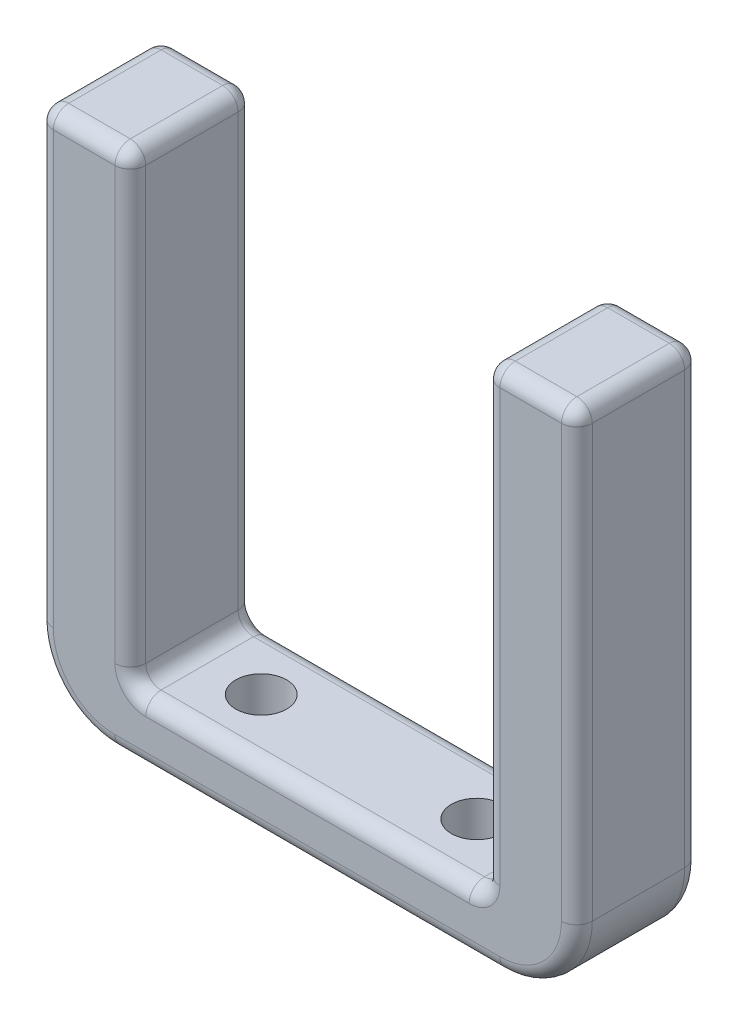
ISO-10303-21;
HEADER;
FILE_DESCRIPTION(('STEP AP214'),'2;1');
FILE_NAME('part.step','',(''),(''),'','','');
FILE_SCHEMA(('AUTOMOTIVE_DESIGN { 1 0 10303 214 1 1 1 1 }'));
ENDSEC;
DATA;
#1=APPLICATION_CONTEXT('core data for automotive mechanical design processes');
#2=APPLICATION_PROTOCOL_DEFINITION('international standard','automotive_design',2000,#1);
#3=PRODUCT_CONTEXT('',#1,'mechanical');
#4=PRODUCT('Part','Part','',(#3));
#5=PRODUCT_RELATED_PRODUCT_CATEGORY('part','',(#4));
#6=PRODUCT_DEFINITION_FORMATION('','',#4);
#7=PRODUCT_DEFINITION_CONTEXT('part definition',#1,'design');
#8=PRODUCT_DEFINITION('design','',#6,#7);
#9=PRODUCT_DEFINITION_SHAPE('','',#8);
#10=(LENGTH_UNIT() NAMED_UNIT(*) SI_UNIT(.MILLI.,.METRE.));
#11=(NAMED_UNIT(*) PLANE_ANGLE_UNIT() SI_UNIT($,.RADIAN.));
#12=(NAMED_UNIT(*) SI_UNIT($,.STERADIAN.) SOLID_ANGLE_UNIT());
#13=UNCERTAINTY_MEASURE_WITH_UNIT(LENGTH_MEASURE(1.E-05),#10,'distance_accuracy_value','');
#14=(GEOMETRIC_REPRESENTATION_CONTEXT(3) GLOBAL_UNCERTAINTY_ASSIGNED_CONTEXT((#13)) GLOBAL_UNIT_ASSIGNED_CONTEXT((#10,
#11,#12)) REPRESENTATION_CONTEXT('',''));
#15=CARTESIAN_POINT('',(0.,0.,0.));
#16=DIRECTION('',(0.,0.,1.));
#17=DIRECTION('',(1.,0.,0.));
#18=AXIS2_PLACEMENT_3D('',#15,#16,#17);
#19=CARTESIAN_POINT('',(0.,0.,8.));
#20=DIRECTION('',(0.,1.,0.));
#21=DIRECTION('',(0.,0.,1.));
#22=AXIS2_PLACEMENT_3D('',#19,#20,#21);
#23=PLANE('',#22);
#24=DIRECTION('',(1.,0.,0.));
#25=VECTOR('',#24,1.);
#26=CARTESIAN_POINT('',(0.,0.,1.));
#27=LINE('',#26,#25);
#28=CARTESIAN_POINT('',(5.,0.,1.));
#29=VERTEX_POINT('',#28);
#30=CARTESIAN_POINT('',(1.,0.,1.));
#31=VERTEX_POINT('',#30);
#32=EDGE_CURVE('E355',#29,#31,#27,.F.);
#33=ORIENTED_EDGE('',*,*,#32,.T.);
#34=DIRECTION('',(0.,0.,-1.));
#35=VECTOR('',#34,1.);
#36=CARTESIAN_POINT('',(1.,0.,8.));
#37=LINE('',#36,#35);
#38=CARTESIAN_POINT('',(1.,0.,7.));
#39=VERTEX_POINT('',#38);
#40=EDGE_CURVE('E359',#31,#39,#37,.F.);
#41=ORIENTED_EDGE('',*,*,#40,.T.);
#42=DIRECTION('',(1.,0.,0.));
#43=VECTOR('',#42,1.);
#44=CARTESIAN_POINT('',(0.,0.,7.));
#45=LINE('',#44,#43);
#46=CARTESIAN_POINT('',(5.,0.,7.));
#47=VERTEX_POINT('',#46);
#48=EDGE_CURVE('E357',#39,#47,#45,.T.);
#49=ORIENTED_EDGE('',*,*,#48,.T.);
#50=DIRECTION('',(0.,0.,1.));
#51=VECTOR('',#50,1.);
#52=CARTESIAN_POINT('',(5.,0.,0.));
#53=LINE('',#52,#51);
#54=EDGE_CURVE('E353',#47,#29,#53,.F.);
#55=ORIENTED_EDGE('',*,*,#54,.T.);
#56=EDGE_LOOP('',(#33,#41,#49,#55));
#57=FACE_BOUND('',#56,.T.);
#58=ADVANCED_FACE('F45',(#57),#23,.T.);
#59=CARTESIAN_POINT('',(0.,0.,8.));
#60=DIRECTION('',(1.,0.,0.));
#61=DIRECTION('',(0.,0.,-1.));
#62=AXIS2_PLACEMENT_3D('',#59,#60,#61);
#63=PLANE('',#62);
#64=DIRECTION('',(0.,0.,-1.));
#65=VECTOR('',#64,1.);
#66=CARTESIAN_POINT('',(0.,-29.,8.));
#67=LINE('',#66,#65);
#68=CARTESIAN_POINT('',(0.,-29.,7.));
#69=VERTEX_POINT('',#68);
#70=CARTESIAN_POINT('',(0.,-29.,1.));
#71=VERTEX_POINT('',#70);
#72=EDGE_CURVE('E256',#69,#71,#67,.T.);
#73=ORIENTED_EDGE('',*,*,#72,.F.);
#74=DIRECTION('',(0.,-1.,0.));
#75=VECTOR('',#74,1.);
#76=CARTESIAN_POINT('',(0.,0.,7.));
#77=LINE('',#76,#75);
#78=CARTESIAN_POINT('',(0.,-1.,7.));
#79=VERTEX_POINT('',#78);
#80=EDGE_CURVE('E351',#69,#79,#77,.F.);
#81=ORIENTED_EDGE('',*,*,#80,.T.);
#82=DIRECTION('',(0.,0.,-1.));
#83=VECTOR('',#82,1.);
#84=CARTESIAN_POINT('',(0.,-1.,0.));
#85=LINE('',#84,#83);
#86=CARTESIAN_POINT('',(0.,-1.,1.));
#87=VERTEX_POINT('',#86);
#88=EDGE_CURVE('E349',#79,#87,#85,.T.);
#89=ORIENTED_EDGE('',*,*,#88,.T.);
#90=DIRECTION('',(0.,-1.,0.));
#91=VECTOR('',#90,1.);
#92=CARTESIAN_POINT('',(0.,0.,1.));
#93=LINE('',#92,#91);
#94=EDGE_CURVE('E347',#87,#71,#93,.T.);
#95=ORIENTED_EDGE('',*,*,#94,.T.);
#96=EDGE_LOOP('',(#73,#81,#89,#95));
#97=FACE_BOUND('',#96,.T.);
#98=ADVANCED_FACE('F550',(#97),#63,.F.);
#99=CARTESIAN_POINT('',(5.,-29.,8.));
#100=DIRECTION('',(0.,0.,-1.));
#101=DIRECTION('',(-1.,0.,0.));
#102=AXIS2_PLACEMENT_3D('',#99,#100,#101);
#103=CYLINDRICAL_SURFACE('',#102,5.);
#104=DIRECTION('',(0.,0.,-1.));
#105=VECTOR('',#104,1.);
#106=CARTESIAN_POINT('',(5.,-34.,8.));
#107=LINE('',#106,#105);
#108=CARTESIAN_POINT('',(5.,-34.,7.));
#109=VERTEX_POINT('',#108);
#110=CARTESIAN_POINT('',(5.,-34.,1.));
#111=VERTEX_POINT('',#110);
#112=EDGE_CURVE('E258',#109,#111,#107,.T.);
#113=ORIENTED_EDGE('',*,*,#112,.F.);
#114=CARTESIAN_POINT('',(5.,-29.,7.));
#115=DIRECTION('',(0.,0.,1.));
#116=DIRECTION('',(1.,0.,0.));
#117=AXIS2_PLACEMENT_3D('',#114,#115,#116);
#118=CIRCLE('',#117,5.);
#119=EDGE_CURVE('E11',#109,#69,#118,.F.);
#120=ORIENTED_EDGE('',*,*,#119,.T.);
#121=ORIENTED_EDGE('',*,*,#72,.T.);
#122=CARTESIAN_POINT('',(5.,-29.,1.));
#123=DIRECTION('',(0.,0.,1.));
#124=DIRECTION('',(1.,0.,0.));
#125=AXIS2_PLACEMENT_3D('',#122,#123,#124);
#126=CIRCLE('',#125,5.);
#127=EDGE_CURVE('E54',#71,#111,#126,.T.);
#128=ORIENTED_EDGE('',*,*,#127,.T.);
#129=EDGE_LOOP('',(#113,#120,#121,#128));
#130=FACE_BOUND('',#129,.T.);
#131=ADVANCED_FACE('F548',(#130),#103,.T.);
#132=CARTESIAN_POINT('',(0.,-34.,8.));
#133=DIRECTION('',(0.,1.,0.));
#134=DIRECTION('',(0.,0.,1.));
#135=AXIS2_PLACEMENT_3D('',#132,#133,#134);
#136=PLANE('',#135);
#137=CARTESIAN_POINT('',(24.5,-34.,4.));
#138=DIRECTION('',(0.,-1.,0.));
#139=DIRECTION('',(0.,0.,-1.));
#140=AXIS2_PLACEMENT_3D('',#137,#138,#139);
#141=CIRCLE('',#140,1.65);
#142=CARTESIAN_POINT('',(24.5,-34.,2.35));
#143=VERTEX_POINT('',#142);
#144=EDGE_CURVE('E481',#143,#143,#141,.T.);
#145=ORIENTED_EDGE('',*,*,#144,.F.);
#146=EDGE_LOOP('',(#145));
#147=FACE_BOUND('',#146,.T.);
#148=CARTESIAN_POINT('',(10.5,-34.,4.));
#149=DIRECTION('',(0.,-1.,0.));
#150=DIRECTION('',(0.,0.,1.));
#151=AXIS2_PLACEMENT_3D('',#148,#149,#150);
#152=CIRCLE('',#151,1.65);
#153=CARTESIAN_POINT('',(10.5,-34.,5.65));
#154=VERTEX_POINT('',#153);
#155=EDGE_CURVE('E486',#154,#154,#152,.T.);
#156=ORIENTED_EDGE('',*,*,#155,.F.);
#157=EDGE_LOOP('',(#156));
#158=FACE_BOUND('',#157,.T.);
#159=DIRECTION('',(0.,0.,-1.));
#160=VECTOR('',#159,1.);
#161=CARTESIAN_POINT('',(30.,-34.,8.));
#162=LINE('',#161,#160);
#163=CARTESIAN_POINT('',(30.,-34.,7.));
#164=VERTEX_POINT('',#163);
#165=CARTESIAN_POINT('',(30.,-34.,1.));
#166=VERTEX_POINT('',#165);
#167=EDGE_CURVE('E507',#164,#166,#162,.T.);
#168=ORIENTED_EDGE('',*,*,#167,.F.);
#169=DIRECTION('',(1.,0.,0.));
#170=VECTOR('',#169,1.);
#171=CARTESIAN_POINT('',(5.,-34.,7.));
#172=LINE('',#171,#170);
#173=EDGE_CURVE('E68',#164,#109,#172,.F.);
#174=ORIENTED_EDGE('',*,*,#173,.T.);
#175=ORIENTED_EDGE('',*,*,#112,.T.);
#176=DIRECTION('',(1.,0.,0.));
#177=VECTOR('',#176,1.);
#178=CARTESIAN_POINT('',(0.,-34.,1.));
#179=LINE('',#178,#177);
#180=EDGE_CURVE('E366',#111,#166,#179,.T.);
#181=ORIENTED_EDGE('',*,*,#180,.T.);
#182=EDGE_LOOP('',(#168,#174,#175,#181));
#183=FACE_BOUND('',#182,.T.);
#184=ADVANCED_FACE('F510',(#147,#158,#183),#136,.F.);
#185=CARTESIAN_POINT('',(30.,-29.,8.));
#186=DIRECTION('',(0.,0.,-1.));
#187=DIRECTION('',(-1.,0.,0.));
#188=AXIS2_PLACEMENT_3D('',#185,#186,#187);
#189=CYLINDRICAL_SURFACE('',#188,5.);
#190=DIRECTION('',(0.,0.,-1.));
#191=VECTOR('',#190,1.);
#192=CARTESIAN_POINT('',(35.,-29.,8.));
#193=LINE('',#192,#191);
#194=CARTESIAN_POINT('',(35.,-29.,7.));
#195=VERTEX_POINT('',#194);
#196=CARTESIAN_POINT('',(35.,-29.,1.));
#197=VERTEX_POINT('',#196);
#198=EDGE_CURVE('E496',#195,#197,#193,.T.);
#199=ORIENTED_EDGE('',*,*,#198,.F.);
#200=CARTESIAN_POINT('',(30.,-29.,7.));
#201=DIRECTION('',(0.,0.,1.));
#202=DIRECTION('',(1.,0.,0.));
#203=AXIS2_PLACEMENT_3D('',#200,#201,#202);
#204=CIRCLE('',#203,5.);
#205=EDGE_CURVE('E364',#195,#164,#204,.F.);
#206=ORIENTED_EDGE('',*,*,#205,.T.);
#207=ORIENTED_EDGE('',*,*,#167,.T.);
#208=CARTESIAN_POINT('',(30.,-29.,1.));
#209=DIRECTION('',(0.,0.,1.));
#210=DIRECTION('',(1.,0.,0.));
#211=AXIS2_PLACEMENT_3D('',#208,#209,#210);
#212=CIRCLE('',#211,5.);
#213=EDGE_CURVE('E362',#166,#197,#212,.T.);
#214=ORIENTED_EDGE('',*,*,#213,.T.);
#215=EDGE_LOOP('',(#199,#206,#207,#214));
#216=FACE_BOUND('',#215,.T.);
#217=ADVANCED_FACE('F523',(#216),#189,.T.);
#218=CARTESIAN_POINT('',(35.,0.,8.));
#219=DIRECTION('',(1.,0.,0.));
#220=DIRECTION('',(0.,0.,-1.));
#221=AXIS2_PLACEMENT_3D('',#218,#219,#220);
#222=PLANE('',#221);
#223=DIRECTION('',(0.,0.,-1.));
#224=VECTOR('',#223,1.);
#225=CARTESIAN_POINT('',(35.,-1.,8.));
#226=LINE('',#225,#224);
#227=CARTESIAN_POINT('',(35.,-1.,1.));
#228=VERTEX_POINT('',#227);
#229=CARTESIAN_POINT('',(35.,-1.,7.));
#230=VERTEX_POINT('',#229);
#231=EDGE_CURVE('E342',#228,#230,#226,.F.);
#232=ORIENTED_EDGE('',*,*,#231,.T.);
#233=DIRECTION('',(0.,-1.,0.));
#234=VECTOR('',#233,1.);
#235=CARTESIAN_POINT('',(35.,0.,7.));
#236=LINE('',#235,#234);
#237=EDGE_CURVE('E345',#230,#195,#236,.T.);
#238=ORIENTED_EDGE('',*,*,#237,.T.);
#239=ORIENTED_EDGE('',*,*,#198,.T.);
#240=DIRECTION('',(0.,-1.,0.));
#241=VECTOR('',#240,1.);
#242=CARTESIAN_POINT('',(35.,0.,1.));
#243=LINE('',#242,#241);
#244=EDGE_CURVE('E340',#197,#228,#243,.F.);
#245=ORIENTED_EDGE('',*,*,#244,.T.);
#246=EDGE_LOOP('',(#232,#238,#239,#245));
#247=FACE_BOUND('',#246,.T.);
#248=ADVANCED_FACE('F526',(#247),#222,.T.);
#249=DIRECTION('',(1.,0.,0.));
#250=VECTOR('',#249,1.);
#251=CARTESIAN_POINT('',(0.,0.,7.));
#252=LINE('',#251,#250);
#253=CARTESIAN_POINT('',(30.,0.,7.));
#254=VERTEX_POINT('',#253);
#255=CARTESIAN_POINT('',(34.,0.,7.));
#256=VERTEX_POINT('',#255);
#257=EDGE_CURVE('E335',#254,#256,#252,.T.);
#258=ORIENTED_EDGE('',*,*,#257,.T.);
#259=DIRECTION('',(0.,0.,-1.));
#260=VECTOR('',#259,1.);
#261=CARTESIAN_POINT('',(34.,0.,8.));
#262=LINE('',#261,#260);
#263=CARTESIAN_POINT('',(34.,0.,1.));
#264=VERTEX_POINT('',#263);
#265=EDGE_CURVE('E337',#256,#264,#262,.T.);
#266=ORIENTED_EDGE('',*,*,#265,.T.);
#267=DIRECTION('',(1.,0.,0.));
#268=VECTOR('',#267,1.);
#269=CARTESIAN_POINT('',(29.,0.,1.));
#270=LINE('',#269,#268);
#271=CARTESIAN_POINT('',(30.,0.,1.));
#272=VERTEX_POINT('',#271);
#273=EDGE_CURVE('E333',#264,#272,#270,.F.);
#274=ORIENTED_EDGE('',*,*,#273,.T.);
#275=DIRECTION('',(0.,0.,1.));
#276=VECTOR('',#275,1.);
#277=CARTESIAN_POINT('',(30.,0.,8.));
#278=LINE('',#277,#276);
#279=EDGE_CURVE('E331',#272,#254,#278,.T.);
#280=ORIENTED_EDGE('',*,*,#279,.T.);
#281=EDGE_LOOP('',(#258,#266,#274,#280));
#282=FACE_BOUND('',#281,.T.);
#283=ADVANCED_FACE('F606',(#282),#23,.T.);
#284=CARTESIAN_POINT('',(0.,0.,8.));
#285=DIRECTION('',(0.,0.,1.));
#286=DIRECTION('',(1.,0.,0.));
#287=AXIS2_PLACEMENT_3D('',#284,#285,#286);
#288=PLANE('',#287);
#289=CARTESIAN_POINT('',(5.,-29.,8.));
#290=DIRECTION('',(0.,0.,1.));
#291=DIRECTION('',(1.,0.,0.));
#292=AXIS2_PLACEMENT_3D('',#289,#290,#291);
#293=CIRCLE('',#292,4.);
#294=CARTESIAN_POINT('',(1.,-29.,8.));
#295=VERTEX_POINT('',#294);
#296=CARTESIAN_POINT('',(5.,-33.,8.));
#297=VERTEX_POINT('',#296);
#298=EDGE_CURVE('E311',#295,#297,#293,.T.);
#299=ORIENTED_EDGE('',*,*,#298,.T.);
#300=DIRECTION('',(1.,0.,0.));
#301=VECTOR('',#300,1.);
#302=CARTESIAN_POINT('',(30.,-33.,8.));
#303=LINE('',#302,#301);
#304=CARTESIAN_POINT('',(30.,-33.,8.));
#305=VERTEX_POINT('',#304);
#306=EDGE_CURVE('E313',#297,#305,#303,.T.);
#307=ORIENTED_EDGE('',*,*,#306,.T.);
#308=CARTESIAN_POINT('',(30.,-29.,8.));
#309=DIRECTION('',(0.,0.,1.));
#310=DIRECTION('',(1.,0.,0.));
#311=AXIS2_PLACEMENT_3D('',#308,#309,#310);
#312=CIRCLE('',#311,4.);
#313=CARTESIAN_POINT('',(34.,-29.,8.));
#314=VERTEX_POINT('',#313);
#315=EDGE_CURVE('E305',#305,#314,#312,.T.);
#316=ORIENTED_EDGE('',*,*,#315,.T.);
#317=DIRECTION('',(0.,-1.,0.));
#318=VECTOR('',#317,1.);
#319=CARTESIAN_POINT('',(34.,0.,8.));
#320=LINE('',#319,#318);
#321=CARTESIAN_POINT('',(34.,-1.,8.));
#322=VERTEX_POINT('',#321);
#323=EDGE_CURVE('E298',#314,#322,#320,.F.);
#324=ORIENTED_EDGE('',*,*,#323,.T.);
#325=DIRECTION('',(1.,0.,0.));
#326=VECTOR('',#325,1.);
#327=CARTESIAN_POINT('',(0.,-1.,8.));
#328=LINE('',#327,#326);
#329=CARTESIAN_POINT('',(30.,-1.,8.));
#330=VERTEX_POINT('',#329);
#331=EDGE_CURVE('E292',#322,#330,#328,.F.);
#332=ORIENTED_EDGE('',*,*,#331,.T.);
#333=DIRECTION('',(0.,1.,0.));
#334=VECTOR('',#333,1.);
#335=CARTESIAN_POINT('',(30.,-29.,8.));
#336=LINE('',#335,#334);
#337=CARTESIAN_POINT('',(30.,-29.,8.));
#338=VERTEX_POINT('',#337);
#339=EDGE_CURVE('E290',#330,#338,#336,.F.);
#340=ORIENTED_EDGE('',*,*,#339,.T.);
#341=CARTESIAN_POINT('',(28.,-29.,8.));
#342=DIRECTION('',(0.,0.,1.));
#343=DIRECTION('',(1.,0.,0.));
#344=AXIS2_PLACEMENT_3D('',#341,#342,#343);
#345=CIRCLE('',#344,2.);
#346=CARTESIAN_POINT('',(28.,-31.,8.));
#347=VERTEX_POINT('',#346);
#348=EDGE_CURVE('E294',#338,#347,#345,.F.);
#349=ORIENTED_EDGE('',*,*,#348,.T.);
#350=DIRECTION('',(1.,0.,0.));
#351=VECTOR('',#350,1.);
#352=CARTESIAN_POINT('',(7.00000000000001,-31.,8.));
#353=LINE('',#352,#351);
#354=CARTESIAN_POINT('',(7.00000000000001,-31.,8.));
#355=VERTEX_POINT('',#354);
#356=EDGE_CURVE('E296',#347,#355,#353,.F.);
#357=ORIENTED_EDGE('',*,*,#356,.T.);
#358=CARTESIAN_POINT('',(7.,-29.,8.));
#359=DIRECTION('',(0.,0.,1.));
#360=DIRECTION('',(1.,0.,0.));
#361=AXIS2_PLACEMENT_3D('',#358,#359,#360);
#362=CIRCLE('',#361,2.);
#363=CARTESIAN_POINT('',(5.,-29.,8.));
#364=VERTEX_POINT('',#363);
#365=EDGE_CURVE('E300',#355,#364,#362,.F.);
#366=ORIENTED_EDGE('',*,*,#365,.T.);
#367=DIRECTION('',(0.,-1.,0.));
#368=VECTOR('',#367,1.);
#369=CARTESIAN_POINT('',(5.,0.,8.));
#370=LINE('',#369,#368);
#371=CARTESIAN_POINT('',(5.,-1.,8.));
#372=VERTEX_POINT('',#371);
#373=EDGE_CURVE('E303',#364,#372,#370,.F.);
#374=ORIENTED_EDGE('',*,*,#373,.T.);
#375=DIRECTION('',(1.,0.,0.));
#376=VECTOR('',#375,1.);
#377=CARTESIAN_POINT('',(0.,-1.,8.));
#378=LINE('',#377,#376);
#379=CARTESIAN_POINT('',(1.,-1.,8.));
#380=VERTEX_POINT('',#379);
#381=EDGE_CURVE('E307',#372,#380,#378,.F.);
#382=ORIENTED_EDGE('',*,*,#381,.T.);
#383=DIRECTION('',(0.,-1.,0.));
#384=VECTOR('',#383,1.);
#385=CARTESIAN_POINT('',(1.,-29.,8.));
#386=LINE('',#385,#384);
#387=EDGE_CURVE('E309',#380,#295,#386,.T.);
#388=ORIENTED_EDGE('',*,*,#387,.T.);
#389=EDGE_LOOP('',(#299,#307,#316,#324,#332,#340,#349,#357,#366,#374,#382,#388));
#390=FACE_BOUND('',#389,.T.);
#391=ADVANCED_FACE('F622',(#390),#288,.T.);
#392=CARTESIAN_POINT('',(0.,0.,0.));
#393=DIRECTION('',(0.,0.,1.));
#394=DIRECTION('',(1.,0.,0.));
#395=AXIS2_PLACEMENT_3D('',#392,#393,#394);
#396=PLANE('',#395);
#397=CARTESIAN_POINT('',(7.,-29.,0.));
#398=DIRECTION('',(0.,0.,1.));
#399=DIRECTION('',(1.,0.,0.));
#400=AXIS2_PLACEMENT_3D('',#397,#398,#399);
#401=CIRCLE('',#400,2.);
#402=CARTESIAN_POINT('',(5.,-29.,0.));
#403=VERTEX_POINT('',#402);
#404=CARTESIAN_POINT('',(7.00000000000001,-31.,0.));
#405=VERTEX_POINT('',#404);
#406=EDGE_CURVE('E277',#403,#405,#401,.T.);
#407=ORIENTED_EDGE('',*,*,#406,.T.);
#408=DIRECTION('',(1.,0.,0.));
#409=VECTOR('',#408,1.);
#410=CARTESIAN_POINT('',(0.,-31.,0.));
#411=LINE('',#410,#409);
#412=CARTESIAN_POINT('',(28.,-31.,0.));
#413=VERTEX_POINT('',#412);
#414=EDGE_CURVE('E279',#405,#413,#411,.T.);
#415=ORIENTED_EDGE('',*,*,#414,.T.);
#416=CARTESIAN_POINT('',(28.,-29.,0.));
#417=DIRECTION('',(0.,0.,1.));
#418=DIRECTION('',(1.,0.,0.));
#419=AXIS2_PLACEMENT_3D('',#416,#417,#418);
#420=CIRCLE('',#419,2.);
#421=CARTESIAN_POINT('',(30.,-29.,0.));
#422=VERTEX_POINT('',#421);
#423=EDGE_CURVE('E275',#413,#422,#420,.T.);
#424=ORIENTED_EDGE('',*,*,#423,.T.);
#425=DIRECTION('',(0.,1.,0.));
#426=VECTOR('',#425,1.);
#427=CARTESIAN_POINT('',(30.,0.,0.));
#428=LINE('',#427,#426);
#429=CARTESIAN_POINT('',(30.,-1.,0.));
#430=VERTEX_POINT('',#429);
#431=EDGE_CURVE('E271',#422,#430,#428,.T.);
#432=ORIENTED_EDGE('',*,*,#431,.T.);
#433=DIRECTION('',(1.,0.,0.));
#434=VECTOR('',#433,1.);
#435=CARTESIAN_POINT('',(35.,-1.,0.));
#436=LINE('',#435,#434);
#437=CARTESIAN_POINT('',(34.,-1.,0.));
#438=VERTEX_POINT('',#437);
#439=EDGE_CURVE('E267',#430,#438,#436,.T.);
#440=ORIENTED_EDGE('',*,*,#439,.T.);
#441=DIRECTION('',(0.,-1.,0.));
#442=VECTOR('',#441,1.);
#443=CARTESIAN_POINT('',(34.,-29.,0.));
#444=LINE('',#443,#442);
#445=CARTESIAN_POINT('',(34.,-29.,0.));
#446=VERTEX_POINT('',#445);
#447=EDGE_CURVE('E265',#438,#446,#444,.T.);
#448=ORIENTED_EDGE('',*,*,#447,.T.);
#449=CARTESIAN_POINT('',(30.,-29.,0.));
#450=DIRECTION('',(0.,0.,1.));
#451=DIRECTION('',(1.,0.,0.));
#452=AXIS2_PLACEMENT_3D('',#449,#450,#451);
#453=CIRCLE('',#452,4.);
#454=CARTESIAN_POINT('',(30.,-33.,0.));
#455=VERTEX_POINT('',#454);
#456=EDGE_CURVE('E263',#446,#455,#453,.F.);
#457=ORIENTED_EDGE('',*,*,#456,.T.);
#458=DIRECTION('',(1.,0.,0.));
#459=VECTOR('',#458,1.);
#460=CARTESIAN_POINT('',(0.,-33.,0.));
#461=LINE('',#460,#459);
#462=CARTESIAN_POINT('',(5.,-33.,0.));
#463=VERTEX_POINT('',#462);
#464=EDGE_CURVE('E239',#455,#463,#461,.F.);
#465=ORIENTED_EDGE('',*,*,#464,.T.);
#466=CARTESIAN_POINT('',(5.,-29.,0.));
#467=DIRECTION('',(0.,0.,1.));
#468=DIRECTION('',(1.,0.,0.));
#469=AXIS2_PLACEMENT_3D('',#466,#467,#468);
#470=CIRCLE('',#469,4.);
#471=CARTESIAN_POINT('',(1.,-29.,0.));
#472=VERTEX_POINT('',#471);
#473=EDGE_CURVE('E231',#463,#472,#470,.F.);
#474=ORIENTED_EDGE('',*,*,#473,.T.);
#475=DIRECTION('',(0.,-1.,0.));
#476=VECTOR('',#475,1.);
#477=CARTESIAN_POINT('',(1.,0.,0.));
#478=LINE('',#477,#476);
#479=CARTESIAN_POINT('',(1.,-1.,0.));
#480=VERTEX_POINT('',#479);
#481=EDGE_CURVE('E236',#472,#480,#478,.F.);
#482=ORIENTED_EDGE('',*,*,#481,.T.);
#483=DIRECTION('',(1.,0.,0.));
#484=VECTOR('',#483,1.);
#485=CARTESIAN_POINT('',(6.,-1.,0.));
#486=LINE('',#485,#484);
#487=CARTESIAN_POINT('',(5.,-1.,0.));
#488=VERTEX_POINT('',#487);
#489=EDGE_CURVE('E269',#480,#488,#486,.T.);
#490=ORIENTED_EDGE('',*,*,#489,.T.);
#491=DIRECTION('',(0.,-1.,0.));
#492=VECTOR('',#491,1.);
#493=CARTESIAN_POINT('',(5.,0.,0.));
#494=LINE('',#493,#492);
#495=EDGE_CURVE('E273',#488,#403,#494,.T.);
#496=ORIENTED_EDGE('',*,*,#495,.T.);
#497=EDGE_LOOP('',(#407,#415,#424,#432,#440,#448,#457,#465,#474,#482,#490,#496));
#498=FACE_BOUND('',#497,.T.);
#499=ADVANCED_FACE('F234',(#498),#396,.F.);
#500=CARTESIAN_POINT('',(28.,-29.,-2.));
#501=DIRECTION('',(0.,0.,1.));
#502=DIRECTION('',(1.,0.,0.));
#503=AXIS2_PLACEMENT_3D('',#500,#501,#502);
#504=CYLINDRICAL_SURFACE('',#503,1.);
#505=DIRECTION('',(0.,0.,1.));
#506=VECTOR('',#505,1.);
#507=CARTESIAN_POINT('',(29.,-29.,-2.));
#508=LINE('',#507,#506);
#509=CARTESIAN_POINT('',(29.,-29.,1.));
#510=VERTEX_POINT('',#509);
#511=CARTESIAN_POINT('',(29.,-29.,7.));
#512=VERTEX_POINT('',#511);
#513=EDGE_CURVE('E478',#510,#512,#508,.T.);
#514=ORIENTED_EDGE('',*,*,#513,.F.);
#515=CARTESIAN_POINT('',(28.,-29.,1.));
#516=DIRECTION('',(0.,0.,1.));
#517=DIRECTION('',(1.,0.,0.));
#518=AXIS2_PLACEMENT_3D('',#515,#516,#517);
#519=CIRCLE('',#518,1.);
#520=CARTESIAN_POINT('',(28.,-30.,1.));
#521=VERTEX_POINT('',#520);
#522=EDGE_CURVE('E288',#510,#521,#519,.F.);
#523=ORIENTED_EDGE('',*,*,#522,.T.);
#524=DIRECTION('',(0.,0.,1.));
#525=VECTOR('',#524,1.);
#526=CARTESIAN_POINT('',(28.,-30.,-2.));
#527=LINE('',#526,#525);
#528=CARTESIAN_POINT('',(28.,-30.,7.));
#529=VERTEX_POINT('',#528);
#530=EDGE_CURVE('E493',#521,#529,#527,.T.);
#531=ORIENTED_EDGE('',*,*,#530,.T.);
#532=CARTESIAN_POINT('',(28.,-29.,7.));
#533=DIRECTION('',(0.,0.,1.));
#534=DIRECTION('',(1.,0.,0.));
#535=AXIS2_PLACEMENT_3D('',#532,#533,#534);
#536=CIRCLE('',#535,1.);
#537=EDGE_CURVE('E286',#529,#512,#536,.T.);
#538=ORIENTED_EDGE('',*,*,#537,.T.);
#539=EDGE_LOOP('',(#514,#523,#531,#538));
#540=FACE_BOUND('',#539,.T.);
#541=ADVANCED_FACE('F1087',(#540),#504,.F.);
#542=CARTESIAN_POINT('',(7.00000000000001,-30.,-2.));
#543=DIRECTION('',(0.,-1.,0.));
#544=DIRECTION('',(0.,0.,-1.));
#545=AXIS2_PLACEMENT_3D('',#542,#543,#544);
#546=PLANE('',#545);
#547=CARTESIAN_POINT('',(24.5,-30.,4.));
#548=DIRECTION('',(0.,-1.,0.));
#549=DIRECTION('',(0.,0.,-1.));
#550=AXIS2_PLACEMENT_3D('',#547,#548,#549);
#551=CIRCLE('',#550,1.65);
#552=CARTESIAN_POINT('',(24.5,-30.,2.35));
#553=VERTEX_POINT('',#552);
#554=EDGE_CURVE('E49',#553,#553,#551,.T.);
#555=ORIENTED_EDGE('',*,*,#554,.T.);
#556=EDGE_LOOP('',(#555));
#557=FACE_BOUND('',#556,.T.);
#558=CARTESIAN_POINT('',(10.5,-30.,4.));
#559=DIRECTION('',(0.,-1.,0.));
#560=DIRECTION('',(0.,0.,-1.));
#561=AXIS2_PLACEMENT_3D('',#558,#559,#560);
#562=CIRCLE('',#561,1.65);
#563=CARTESIAN_POINT('',(10.5,-30.,2.35));
#564=VERTEX_POINT('',#563);
#565=EDGE_CURVE('E479',#564,#564,#562,.T.);
#566=ORIENTED_EDGE('',*,*,#565,.T.);
#567=EDGE_LOOP('',(#566));
#568=FACE_BOUND('',#567,.T.);
#569=ORIENTED_EDGE('',*,*,#530,.F.);
#570=DIRECTION('',(1.,0.,0.));
#571=VECTOR('',#570,1.);
#572=CARTESIAN_POINT('',(7.00000000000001,-30.,1.));
#573=LINE('',#572,#571);
#574=CARTESIAN_POINT('',(7.00000000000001,-30.,1.));
#575=VERTEX_POINT('',#574);
#576=EDGE_CURVE('E323',#521,#575,#573,.F.);
#577=ORIENTED_EDGE('',*,*,#576,.T.);
#578=DIRECTION('',(0.,0.,1.));
#579=VECTOR('',#578,1.);
#580=CARTESIAN_POINT('',(7.00000000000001,-30.,-2.));
#581=LINE('',#580,#579);
#582=CARTESIAN_POINT('',(7.00000000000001,-30.,7.));
#583=VERTEX_POINT('',#582);
#584=EDGE_CURVE('E497',#575,#583,#581,.T.);
#585=ORIENTED_EDGE('',*,*,#584,.T.);
#586=DIRECTION('',(1.,0.,0.));
#587=VECTOR('',#586,1.);
#588=CARTESIAN_POINT('',(28.,-30.,7.));
#589=LINE('',#588,#587);
#590=EDGE_CURVE('E321',#583,#529,#589,.T.);
#591=ORIENTED_EDGE('',*,*,#590,.T.);
#592=EDGE_LOOP('',(#569,#577,#585,#591));
#593=FACE_BOUND('',#592,.T.);
#594=ADVANCED_FACE('F1076',(#557,#568,#593),#546,.F.);
#595=CARTESIAN_POINT('',(7.,-29.,-2.));
#596=DIRECTION('',(0.,0.,1.));
#597=DIRECTION('',(1.,0.,0.));
#598=AXIS2_PLACEMENT_3D('',#595,#596,#597);
#599=CYLINDRICAL_SURFACE('',#598,1.);
#600=ORIENTED_EDGE('',*,*,#584,.F.);
#601=CARTESIAN_POINT('',(7.,-29.,1.));
#602=DIRECTION('',(0.,0.,1.));
#603=DIRECTION('',(1.,0.,0.));
#604=AXIS2_PLACEMENT_3D('',#601,#602,#603);
#605=CIRCLE('',#604,1.);
#606=CARTESIAN_POINT('',(6.,-29.,1.));
#607=VERTEX_POINT('',#606);
#608=EDGE_CURVE('E283',#575,#607,#605,.F.);
#609=ORIENTED_EDGE('',*,*,#608,.T.);
#610=DIRECTION('',(0.,0.,1.));
#611=VECTOR('',#610,1.);
#612=CARTESIAN_POINT('',(6.,-29.,-2.));
#613=LINE('',#612,#611);
#614=CARTESIAN_POINT('',(6.,-29.,7.));
#615=VERTEX_POINT('',#614);
#616=EDGE_CURVE('E500',#607,#615,#613,.T.);
#617=ORIENTED_EDGE('',*,*,#616,.T.);
#618=CARTESIAN_POINT('',(7.,-29.,7.));
#619=DIRECTION('',(0.,0.,1.));
#620=DIRECTION('',(1.,0.,0.));
#621=AXIS2_PLACEMENT_3D('',#618,#619,#620);
#622=CIRCLE('',#621,1.);
#623=EDGE_CURVE('E281',#615,#583,#622,.T.);
#624=ORIENTED_EDGE('',*,*,#623,.T.);
#625=EDGE_LOOP('',(#600,#609,#617,#624));
#626=FACE_BOUND('',#625,.T.);
#627=ADVANCED_FACE('F1065',(#626),#599,.F.);
#628=CARTESIAN_POINT('',(6.,0.,-2.));
#629=DIRECTION('',(-1.,0.,0.));
#630=DIRECTION('',(0.,-1.,0.));
#631=AXIS2_PLACEMENT_3D('',#628,#629,#630);
#632=PLANE('',#631);
#633=ORIENTED_EDGE('',*,*,#616,.F.);
#634=DIRECTION('',(0.,-1.,0.));
#635=VECTOR('',#634,1.);
#636=CARTESIAN_POINT('',(6.,0.,1.));
#637=LINE('',#636,#635);
#638=CARTESIAN_POINT('',(6.,-1.,1.));
#639=VERTEX_POINT('',#638);
#640=EDGE_CURVE('E319',#607,#639,#637,.F.);
#641=ORIENTED_EDGE('',*,*,#640,.T.);
#642=DIRECTION('',(0.,0.,1.));
#643=VECTOR('',#642,1.);
#644=CARTESIAN_POINT('',(6.,-1.,8.));
#645=LINE('',#644,#643);
#646=CARTESIAN_POINT('',(6.,-1.,7.));
#647=VERTEX_POINT('',#646);
#648=EDGE_CURVE('E317',#639,#647,#645,.T.);
#649=ORIENTED_EDGE('',*,*,#648,.T.);
#650=DIRECTION('',(0.,-1.,0.));
#651=VECTOR('',#650,1.);
#652=CARTESIAN_POINT('',(6.,-29.,7.));
#653=LINE('',#652,#651);
#654=EDGE_CURVE('E315',#647,#615,#653,.T.);
#655=ORIENTED_EDGE('',*,*,#654,.T.);
#656=EDGE_LOOP('',(#633,#641,#649,#655));
#657=FACE_BOUND('',#656,.T.);
#658=ADVANCED_FACE('F1054',(#657),#632,.F.);
#659=CARTESIAN_POINT('',(29.,-29.,-2.));
#660=DIRECTION('',(1.,0.,0.));
#661=DIRECTION('',(0.,1.,0.));
#662=AXIS2_PLACEMENT_3D('',#659,#660,#661);
#663=PLANE('',#662);
#664=DIRECTION('',(0.,0.,1.));
#665=VECTOR('',#664,1.);
#666=CARTESIAN_POINT('',(29.,-1.,0.));
#667=LINE('',#666,#665);
#668=CARTESIAN_POINT('',(29.,-1.,7.));
#669=VERTEX_POINT('',#668);
#670=CARTESIAN_POINT('',(29.,-1.,1.));
#671=VERTEX_POINT('',#670);
#672=EDGE_CURVE('E327',#669,#671,#667,.F.);
#673=ORIENTED_EDGE('',*,*,#672,.T.);
#674=DIRECTION('',(0.,1.,0.));
#675=VECTOR('',#674,1.);
#676=CARTESIAN_POINT('',(29.,-29.,1.));
#677=LINE('',#676,#675);
#678=EDGE_CURVE('E329',#671,#510,#677,.F.);
#679=ORIENTED_EDGE('',*,*,#678,.T.);
#680=ORIENTED_EDGE('',*,*,#513,.T.);
#681=DIRECTION('',(0.,1.,0.));
#682=VECTOR('',#681,1.);
#683=CARTESIAN_POINT('',(29.,0.,7.));
#684=LINE('',#683,#682);
#685=EDGE_CURVE('E325',#512,#669,#684,.T.);
#686=ORIENTED_EDGE('',*,*,#685,.T.);
#687=EDGE_LOOP('',(#673,#679,#680,#686));
#688=FACE_BOUND('',#687,.T.);
#689=ADVANCED_FACE('F1045',(#688),#663,.F.);
#690=CARTESIAN_POINT('',(30.,-29.,7.));
#691=DIRECTION('',(0.,0.,1.));
#692=DIRECTION('',(1.,0.,0.));
#693=AXIS2_PLACEMENT_3D('',#690,#691,#692);
#694=TOROIDAL_SURFACE('',#693,4.,1.);
#695=CARTESIAN_POINT('',(34.,-29.,7.));
#696=DIRECTION('',(0.,1.,0.));
#697=DIRECTION('',(0.,0.,1.));
#698=AXIS2_PLACEMENT_3D('',#695,#696,#697);
#699=CIRCLE('',#698,1.);
#700=EDGE_CURVE('E473',#314,#195,#699,.T.);
#701=ORIENTED_EDGE('',*,*,#700,.F.);
#702=ORIENTED_EDGE('',*,*,#315,.F.);
#703=CARTESIAN_POINT('',(30.,-33.,7.));
#704=DIRECTION('',(-1.,0.,0.));
#705=DIRECTION('',(0.,0.,1.));
#706=AXIS2_PLACEMENT_3D('',#703,#704,#705);
#707=CIRCLE('',#706,1.);
#708=EDGE_CURVE('E476',#164,#305,#707,.T.);
#709=ORIENTED_EDGE('',*,*,#708,.F.);
#710=ORIENTED_EDGE('',*,*,#205,.F.);
#711=EDGE_LOOP('',(#701,#702,#709,#710));
#712=FACE_BOUND('',#711,.T.);
#713=ADVANCED_FACE('F47',(#712),#694,.T.);
#714=CARTESIAN_POINT('',(0.,-33.,7.));
#715=DIRECTION('',(-1.,0.,0.));
#716=DIRECTION('',(0.,0.,1.));
#717=AXIS2_PLACEMENT_3D('',#714,#715,#716);
#718=CYLINDRICAL_SURFACE('',#717,1.);
#719=ORIENTED_EDGE('',*,*,#708,.T.);
#720=ORIENTED_EDGE('',*,*,#306,.F.);
#721=CARTESIAN_POINT('',(5.,-33.,7.));
#722=DIRECTION('',(-1.,0.,0.));
#723=DIRECTION('',(0.,0.,1.));
#724=AXIS2_PLACEMENT_3D('',#721,#722,#723);
#725=CIRCLE('',#724,1.);
#726=EDGE_CURVE('E470',#109,#297,#725,.T.);
#727=ORIENTED_EDGE('',*,*,#726,.F.);
#728=ORIENTED_EDGE('',*,*,#173,.F.);
#729=EDGE_LOOP('',(#719,#720,#727,#728));
#730=FACE_BOUND('',#729,.T.);
#731=ADVANCED_FACE('F540',(#730),#718,.T.);
#732=CARTESIAN_POINT('',(34.,0.,7.));
#733=DIRECTION('',(0.,-1.,0.));
#734=DIRECTION('',(0.,0.,-1.));
#735=AXIS2_PLACEMENT_3D('',#732,#733,#734);
#736=CYLINDRICAL_SURFACE('',#735,1.);
#737=ORIENTED_EDGE('',*,*,#700,.T.);
#738=ORIENTED_EDGE('',*,*,#237,.F.);
#739=CARTESIAN_POINT('',(34.,-1.,7.));
#740=DIRECTION('',(0.,1.,0.));
#741=DIRECTION('',(0.,0.,1.));
#742=AXIS2_PLACEMENT_3D('',#739,#740,#741);
#743=CIRCLE('',#742,1.);
#744=EDGE_CURVE('E467',#322,#230,#743,.T.);
#745=ORIENTED_EDGE('',*,*,#744,.F.);
#746=ORIENTED_EDGE('',*,*,#323,.F.);
#747=EDGE_LOOP('',(#737,#738,#745,#746));
#748=FACE_BOUND('',#747,.T.);
#749=ADVANCED_FACE('F531',(#748),#736,.T.);
#750=CARTESIAN_POINT('',(5.,-29.,7.));
#751=DIRECTION('',(0.,0.,1.));
#752=DIRECTION('',(1.,0.,0.));
#753=AXIS2_PLACEMENT_3D('',#750,#751,#752);
#754=TOROIDAL_SURFACE('',#753,4.,1.);
#755=ORIENTED_EDGE('',*,*,#726,.T.);
#756=ORIENTED_EDGE('',*,*,#298,.F.);
#757=CARTESIAN_POINT('',(0.999999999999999,-29.,7.));
#758=DIRECTION('',(0.,1.,0.));
#759=DIRECTION('',(0.,0.,1.));
#760=AXIS2_PLACEMENT_3D('',#757,#758,#759);
#761=CIRCLE('',#760,1.);
#762=EDGE_CURVE('E461',#69,#295,#761,.T.);
#763=ORIENTED_EDGE('',*,*,#762,.F.);
#764=ORIENTED_EDGE('',*,*,#119,.F.);
#765=EDGE_LOOP('',(#755,#756,#763,#764));
#766=FACE_BOUND('',#765,.T.);
#767=ADVANCED_FACE('F545',(#766),#754,.T.);
#768=CARTESIAN_POINT('',(30.,-29.,1.));
#769=DIRECTION('',(0.,0.,1.));
#770=DIRECTION('',(1.,0.,0.));
#771=AXIS2_PLACEMENT_3D('',#768,#769,#770);
#772=TOROIDAL_SURFACE('',#771,4.,1.);
#773=CARTESIAN_POINT('',(34.,-29.,1.));
#774=DIRECTION('',(0.,1.,0.));
#775=DIRECTION('',(0.,0.,1.));
#776=AXIS2_PLACEMENT_3D('',#773,#774,#775);
#777=CIRCLE('',#776,1.);
#778=EDGE_CURVE('E455',#197,#446,#777,.T.);
#779=ORIENTED_EDGE('',*,*,#778,.F.);
#780=ORIENTED_EDGE('',*,*,#213,.F.);
#781=CARTESIAN_POINT('',(30.,-33.,1.));
#782=DIRECTION('',(-1.,0.,0.));
#783=DIRECTION('',(0.,0.,1.));
#784=AXIS2_PLACEMENT_3D('',#781,#782,#783);
#785=CIRCLE('',#784,1.);
#786=EDGE_CURVE('E458',#455,#166,#785,.T.);
#787=ORIENTED_EDGE('',*,*,#786,.F.);
#788=ORIENTED_EDGE('',*,*,#456,.F.);
#789=EDGE_LOOP('',(#779,#780,#787,#788));
#790=FACE_BOUND('',#789,.T.);
#791=ADVANCED_FACE('F519',(#790),#772,.T.);
#792=CARTESIAN_POINT('',(34.,-1.,7.));
#793=DIRECTION('',(1.,0.,0.));
#794=DIRECTION('',(0.,0.,-1.));
#795=AXIS2_PLACEMENT_3D('',#792,#793,#794);
#796=SPHERICAL_SURFACE('',#795,1.);
#797=CARTESIAN_POINT('',(34.,-1.,7.));
#798=DIRECTION('',(1.,0.,0.));
#799=DIRECTION('',(0.,0.,-1.));
#800=AXIS2_PLACEMENT_3D('',#797,#798,#799);
#801=CIRCLE('',#800,1.);
#802=EDGE_CURVE('E450',#322,#256,#801,.F.);
#803=ORIENTED_EDGE('',*,*,#802,.F.);
#804=ORIENTED_EDGE('',*,*,#744,.T.);
#805=CARTESIAN_POINT('',(34.,-1.,7.));
#806=DIRECTION('',(0.,0.,1.));
#807=DIRECTION('',(1.,0.,0.));
#808=AXIS2_PLACEMENT_3D('',#805,#806,#807);
#809=CIRCLE('',#808,1.);
#810=EDGE_CURVE('E453',#256,#230,#809,.F.);
#811=ORIENTED_EDGE('',*,*,#810,.F.);
#812=EDGE_LOOP('',(#803,#804,#811));
#813=FACE_BOUND('',#812,.T.);
#814=ADVANCED_FACE('F990',(#813),#796,.T.);
#815=CARTESIAN_POINT('',(28.,-29.,7.));
#816=DIRECTION('',(0.,0.,1.));
#817=DIRECTION('',(1.,0.,0.));
#818=AXIS2_PLACEMENT_3D('',#815,#816,#817);
#819=TOROIDAL_SURFACE('',#818,2.,1.);
#820=CARTESIAN_POINT('',(30.,-29.,7.));
#821=DIRECTION('',(0.,1.,0.));
#822=DIRECTION('',(-1.,0.,0.));
#823=AXIS2_PLACEMENT_3D('',#820,#821,#822);
#824=CIRCLE('',#823,1.);
#825=EDGE_CURVE('E447',#512,#338,#824,.T.);
#826=ORIENTED_EDGE('',*,*,#825,.F.);
#827=ORIENTED_EDGE('',*,*,#537,.F.);
#828=CARTESIAN_POINT('',(28.,-31.,7.));
#829=DIRECTION('',(-1.,0.,0.));
#830=DIRECTION('',(0.,-1.,0.));
#831=AXIS2_PLACEMENT_3D('',#828,#829,#830);
#832=CIRCLE('',#831,1.);
#833=EDGE_CURVE('E464',#347,#529,#832,.T.);
#834=ORIENTED_EDGE('',*,*,#833,.F.);
#835=ORIENTED_EDGE('',*,*,#348,.F.);
#836=EDGE_LOOP('',(#826,#827,#834,#835));
#837=FACE_BOUND('',#836,.T.);
#838=ADVANCED_FACE('F625',(#837),#819,.T.);
#839=CARTESIAN_POINT('',(7.00000000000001,-31.,7.));
#840=DIRECTION('',(-1.,0.,0.));
#841=DIRECTION('',(0.,0.,1.));
#842=AXIS2_PLACEMENT_3D('',#839,#840,#841);
#843=CYLINDRICAL_SURFACE('',#842,1.);
#844=ORIENTED_EDGE('',*,*,#833,.T.);
#845=ORIENTED_EDGE('',*,*,#590,.F.);
#846=CARTESIAN_POINT('',(7.00000000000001,-31.,7.));
#847=DIRECTION('',(-1.,0.,0.));
#848=DIRECTION('',(0.,-1.,0.));
#849=AXIS2_PLACEMENT_3D('',#846,#847,#848);
#850=CIRCLE('',#849,1.);
#851=EDGE_CURVE('E444',#355,#583,#850,.T.);
#852=ORIENTED_EDGE('',*,*,#851,.F.);
#853=ORIENTED_EDGE('',*,*,#356,.F.);
#854=EDGE_LOOP('',(#844,#845,#852,#853));
#855=FACE_BOUND('',#854,.T.);
#856=ADVANCED_FACE('F631',(#855),#843,.T.);
#857=CARTESIAN_POINT('',(1.,0.,7.));
#858=DIRECTION('',(0.,1.,0.));
#859=DIRECTION('',(0.,0.,1.));
#860=AXIS2_PLACEMENT_3D('',#857,#858,#859);
#861=CYLINDRICAL_SURFACE('',#860,1.);
#862=ORIENTED_EDGE('',*,*,#762,.T.);
#863=ORIENTED_EDGE('',*,*,#387,.F.);
#864=CARTESIAN_POINT('',(1.,-1.,7.));
#865=DIRECTION('',(0.,1.,0.));
#866=DIRECTION('',(0.,0.,1.));
#867=AXIS2_PLACEMENT_3D('',#864,#865,#866);
#868=CIRCLE('',#867,1.);
#869=EDGE_CURVE('E441',#79,#380,#868,.T.);
#870=ORIENTED_EDGE('',*,*,#869,.F.);
#871=ORIENTED_EDGE('',*,*,#80,.F.);
#872=EDGE_LOOP('',(#862,#863,#870,#871));
#873=FACE_BOUND('',#872,.T.);
#874=ADVANCED_FACE('F652',(#873),#861,.T.);
#875=CARTESIAN_POINT('',(0.,-33.,1.));
#876=DIRECTION('',(1.,0.,0.));
#877=DIRECTION('',(0.,0.,-1.));
#878=AXIS2_PLACEMENT_3D('',#875,#876,#877);
#879=CYLINDRICAL_SURFACE('',#878,1.);
#880=ORIENTED_EDGE('',*,*,#786,.T.);
#881=ORIENTED_EDGE('',*,*,#180,.F.);
#882=CARTESIAN_POINT('',(5.,-33.,1.));
#883=DIRECTION('',(-1.,0.,0.));
#884=DIRECTION('',(0.,0.,1.));
#885=AXIS2_PLACEMENT_3D('',#882,#883,#884);
#886=CIRCLE('',#885,1.);
#887=EDGE_CURVE('E439',#463,#111,#886,.T.);
#888=ORIENTED_EDGE('',*,*,#887,.F.);
#889=ORIENTED_EDGE('',*,*,#464,.F.);
#890=EDGE_LOOP('',(#880,#881,#888,#889));
#891=FACE_BOUND('',#890,.T.);
#892=ADVANCED_FACE('F513',(#891),#879,.T.);
#893=CARTESIAN_POINT('',(34.,0.,1.));
#894=DIRECTION('',(0.,1.,0.));
#895=DIRECTION('',(0.,0.,1.));
#896=AXIS2_PLACEMENT_3D('',#893,#894,#895);
#897=CYLINDRICAL_SURFACE('',#896,1.);
#898=ORIENTED_EDGE('',*,*,#778,.T.);
#899=ORIENTED_EDGE('',*,*,#447,.F.);
#900=CARTESIAN_POINT('',(34.,-1.,1.));
#901=DIRECTION('',(0.,1.,0.));
#902=DIRECTION('',(0.,0.,1.));
#903=AXIS2_PLACEMENT_3D('',#900,#901,#902);
#904=CIRCLE('',#903,1.);
#905=EDGE_CURVE('E436',#228,#438,#904,.T.);
#906=ORIENTED_EDGE('',*,*,#905,.F.);
#907=ORIENTED_EDGE('',*,*,#244,.F.);
#908=EDGE_LOOP('',(#898,#899,#906,#907));
#909=FACE_BOUND('',#908,.T.);
#910=ADVANCED_FACE('F942',(#909),#897,.T.);
#911=CARTESIAN_POINT('',(34.,-1.,8.));
#912=DIRECTION('',(0.,0.,-1.));
#913=DIRECTION('',(-1.,0.,0.));
#914=AXIS2_PLACEMENT_3D('',#911,#912,#913);
#915=CYLINDRICAL_SURFACE('',#914,1.);
#916=ORIENTED_EDGE('',*,*,#810,.T.);
#917=ORIENTED_EDGE('',*,*,#231,.F.);
#918=CARTESIAN_POINT('',(34.,-1.,1.));
#919=DIRECTION('',(0.,0.,-1.));
#920=DIRECTION('',(-1.,0.,0.));
#921=AXIS2_PLACEMENT_3D('',#918,#919,#920);
#922=CIRCLE('',#921,1.);
#923=EDGE_CURVE('E433',#264,#228,#922,.T.);
#924=ORIENTED_EDGE('',*,*,#923,.F.);
#925=ORIENTED_EDGE('',*,*,#265,.F.);
#926=EDGE_LOOP('',(#916,#917,#924,#925));
#927=FACE_BOUND('',#926,.T.);
#928=ADVANCED_FACE('F932',(#927),#915,.T.);
#929=CARTESIAN_POINT('',(0.,-1.,7.));
#930=DIRECTION('',(1.,0.,0.));
#931=DIRECTION('',(0.,0.,-1.));
#932=AXIS2_PLACEMENT_3D('',#929,#930,#931);
#933=CYLINDRICAL_SURFACE('',#932,1.);
#934=ORIENTED_EDGE('',*,*,#802,.T.);
#935=ORIENTED_EDGE('',*,*,#257,.F.);
#936=CARTESIAN_POINT('',(30.,-1.,7.));
#937=DIRECTION('',(-1.,0.,0.));
#938=DIRECTION('',(0.,0.,1.));
#939=AXIS2_PLACEMENT_3D('',#936,#937,#938);
#940=CIRCLE('',#939,1.);
#941=EDGE_CURVE('E430',#330,#254,#940,.T.);
#942=ORIENTED_EDGE('',*,*,#941,.F.);
#943=ORIENTED_EDGE('',*,*,#331,.F.);
#944=EDGE_LOOP('',(#934,#935,#942,#943));
#945=FACE_BOUND('',#944,.T.);
#946=ADVANCED_FACE('F609',(#945),#933,.T.);
#947=CARTESIAN_POINT('',(30.,-29.,7.));
#948=DIRECTION('',(0.,-1.,0.));
#949=DIRECTION('',(1.,0.,0.));
#950=AXIS2_PLACEMENT_3D('',#947,#948,#949);
#951=CYLINDRICAL_SURFACE('',#950,1.);
#952=ORIENTED_EDGE('',*,*,#825,.T.);
#953=ORIENTED_EDGE('',*,*,#339,.F.);
#954=CARTESIAN_POINT('',(30.,-1.,7.));
#955=DIRECTION('',(0.,1.,0.));
#956=DIRECTION('',(-1.,0.,0.));
#957=AXIS2_PLACEMENT_3D('',#954,#955,#956);
#958=CIRCLE('',#957,1.);
#959=EDGE_CURVE('E427',#669,#330,#958,.T.);
#960=ORIENTED_EDGE('',*,*,#959,.F.);
#961=ORIENTED_EDGE('',*,*,#685,.F.);
#962=EDGE_LOOP('',(#952,#953,#960,#961));
#963=FACE_BOUND('',#962,.T.);
#964=ADVANCED_FACE('F618',(#963),#951,.T.);
#965=CARTESIAN_POINT('',(7.,-29.,7.));
#966=DIRECTION('',(0.,0.,1.));
#967=DIRECTION('',(1.,0.,0.));
#968=AXIS2_PLACEMENT_3D('',#965,#966,#967);
#969=TOROIDAL_SURFACE('',#968,2.,1.);
#970=ORIENTED_EDGE('',*,*,#851,.T.);
#971=ORIENTED_EDGE('',*,*,#623,.F.);
#972=CARTESIAN_POINT('',(5.,-29.,7.));
#973=DIRECTION('',(0.,1.,0.));
#974=DIRECTION('',(0.,0.,1.));
#975=AXIS2_PLACEMENT_3D('',#972,#973,#974);
#976=CIRCLE('',#975,1.);
#977=EDGE_CURVE('E424',#364,#615,#976,.T.);
#978=ORIENTED_EDGE('',*,*,#977,.F.);
#979=ORIENTED_EDGE('',*,*,#365,.F.);
#980=EDGE_LOOP('',(#970,#971,#978,#979));
#981=FACE_BOUND('',#980,.T.);
#982=ADVANCED_FACE('F636',(#981),#969,.T.);
#983=CARTESIAN_POINT('',(1.,-1.,7.));
#984=DIRECTION('',(0.,0.,1.));
#985=DIRECTION('',(1.,0.,0.));
#986=AXIS2_PLACEMENT_3D('',#983,#984,#985);
#987=SPHERICAL_SURFACE('',#986,1.);
#988=CARTESIAN_POINT('',(1.,-1.,7.));
#989=DIRECTION('',(0.,0.,1.));
#990=DIRECTION('',(1.,0.,0.));
#991=AXIS2_PLACEMENT_3D('',#988,#989,#990);
#992=CIRCLE('',#991,1.);
#993=EDGE_CURVE('E249',#79,#39,#992,.F.);
#994=ORIENTED_EDGE('',*,*,#993,.F.);
#995=ORIENTED_EDGE('',*,*,#869,.T.);
#996=CARTESIAN_POINT('',(1.,-1.,7.));
#997=DIRECTION('',(-1.,0.,0.));
#998=DIRECTION('',(0.,0.,1.));
#999=AXIS2_PLACEMENT_3D('',#996,#997,#998);
#1000=CIRCLE('',#999,1.);
#1001=EDGE_CURVE('E421',#39,#380,#1000,.F.);
#1002=ORIENTED_EDGE('',*,*,#1001,.F.);
#1003=EDGE_LOOP('',(#994,#995,#1002));
#1004=FACE_BOUND('',#1003,.T.);
#1005=ADVANCED_FACE('F655',(#1004),#987,.T.);
#1006=CARTESIAN_POINT('',(5.,-29.,1.));
#1007=DIRECTION('',(0.,0.,1.));
#1008=DIRECTION('',(1.,0.,0.));
#1009=AXIS2_PLACEMENT_3D('',#1006,#1007,#1008);
#1010=TOROIDAL_SURFACE('',#1009,4.,1.);
#1011=ORIENTED_EDGE('',*,*,#887,.T.);
#1012=ORIENTED_EDGE('',*,*,#127,.F.);
#1013=CARTESIAN_POINT('',(0.999999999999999,-29.,1.));
#1014=DIRECTION('',(0.,1.,0.));
#1015=DIRECTION('',(0.,0.,1.));
#1016=AXIS2_PLACEMENT_3D('',#1013,#1014,#1015);
#1017=CIRCLE('',#1016,1.);
#1018=EDGE_CURVE('E245',#472,#71,#1017,.T.);
#1019=ORIENTED_EDGE('',*,*,#1018,.F.);
#1020=ORIENTED_EDGE('',*,*,#473,.F.);
#1021=EDGE_LOOP('',(#1011,#1012,#1019,#1020));
#1022=FACE_BOUND('',#1021,.T.);
#1023=ADVANCED_FACE('F246',(#1022),#1010,.T.);
#1024=CARTESIAN_POINT('',(34.,-1.,1.));
#1025=DIRECTION('',(1.,0.,0.));
#1026=DIRECTION('',(0.,0.,-1.));
#1027=AXIS2_PLACEMENT_3D('',#1024,#1025,#1026);
#1028=SPHERICAL_SURFACE('',#1027,1.);
#1029=ORIENTED_EDGE('',*,*,#923,.T.);
#1030=ORIENTED_EDGE('',*,*,#905,.T.);
#1031=CARTESIAN_POINT('',(34.,-1.,1.));
#1032=DIRECTION('',(1.,0.,0.));
#1033=DIRECTION('',(0.,0.,-1.));
#1034=AXIS2_PLACEMENT_3D('',#1031,#1032,#1033);
#1035=CIRCLE('',#1034,1.);
#1036=EDGE_CURVE('E250',#264,#438,#1035,.F.);
#1037=ORIENTED_EDGE('',*,*,#1036,.F.);
#1038=EDGE_LOOP('',(#1029,#1030,#1037));
#1039=FACE_BOUND('',#1038,.T.);
#1040=ADVANCED_FACE('F876',(#1039),#1028,.T.);
#1041=CARTESIAN_POINT('',(30.,-1.,7.));
#1042=DIRECTION('',(0.,0.,1.));
#1043=DIRECTION('',(1.,0.,0.));
#1044=AXIS2_PLACEMENT_3D('',#1041,#1042,#1043);
#1045=SPHERICAL_SURFACE('',#1044,1.);
#1046=ORIENTED_EDGE('',*,*,#959,.T.);
#1047=ORIENTED_EDGE('',*,*,#941,.T.);
#1048=CARTESIAN_POINT('',(30.,-1.,7.));
#1049=DIRECTION('',(0.,0.,1.));
#1050=DIRECTION('',(1.,0.,0.));
#1051=AXIS2_PLACEMENT_3D('',#1048,#1049,#1050);
#1052=CIRCLE('',#1051,1.);
#1053=EDGE_CURVE('E414',#669,#254,#1052,.F.);
#1054=ORIENTED_EDGE('',*,*,#1053,.F.);
#1055=EDGE_LOOP('',(#1046,#1047,#1054));
#1056=FACE_BOUND('',#1055,.T.);
#1057=ADVANCED_FACE('F613',(#1056),#1045,.T.);
#1058=CARTESIAN_POINT('',(5.,0.,7.));
#1059=DIRECTION('',(0.,1.,0.));
#1060=DIRECTION('',(-1.,0.,0.));
#1061=AXIS2_PLACEMENT_3D('',#1058,#1059,#1060);
#1062=CYLINDRICAL_SURFACE('',#1061,1.);
#1063=ORIENTED_EDGE('',*,*,#977,.T.);
#1064=ORIENTED_EDGE('',*,*,#654,.F.);
#1065=CARTESIAN_POINT('',(5.,-1.,7.));
#1066=DIRECTION('',(0.,1.,0.));
#1067=DIRECTION('',(0.,0.,1.));
#1068=AXIS2_PLACEMENT_3D('',#1065,#1066,#1067);
#1069=CIRCLE('',#1068,1.);
#1070=EDGE_CURVE('E411',#372,#647,#1069,.T.);
#1071=ORIENTED_EDGE('',*,*,#1070,.F.);
#1072=ORIENTED_EDGE('',*,*,#373,.F.);
#1073=EDGE_LOOP('',(#1063,#1064,#1071,#1072));
#1074=FACE_BOUND('',#1073,.T.);
#1075=ADVANCED_FACE('F640',(#1074),#1062,.T.);
#1076=CARTESIAN_POINT('',(0.,-1.,7.));
#1077=DIRECTION('',(1.,0.,0.));
#1078=DIRECTION('',(0.,0.,-1.));
#1079=AXIS2_PLACEMENT_3D('',#1076,#1077,#1078);
#1080=CYLINDRICAL_SURFACE('',#1079,1.);
#1081=ORIENTED_EDGE('',*,*,#1001,.T.);
#1082=ORIENTED_EDGE('',*,*,#381,.F.);
#1083=CARTESIAN_POINT('',(5.,-1.,7.));
#1084=DIRECTION('',(1.,0.,0.));
#1085=DIRECTION('',(0.,0.,-1.));
#1086=AXIS2_PLACEMENT_3D('',#1083,#1084,#1085);
#1087=CIRCLE('',#1086,1.);
#1088=EDGE_CURVE('E408',#47,#372,#1087,.T.);
#1089=ORIENTED_EDGE('',*,*,#1088,.F.);
#1090=ORIENTED_EDGE('',*,*,#48,.F.);
#1091=EDGE_LOOP('',(#1081,#1082,#1089,#1090));
#1092=FACE_BOUND('',#1091,.T.);
#1093=ADVANCED_FACE('F648',(#1092),#1080,.T.);
#1094=CARTESIAN_POINT('',(1.,-1.,8.));
#1095=DIRECTION('',(0.,0.,1.));
#1096=DIRECTION('',(1.,0.,0.));
#1097=AXIS2_PLACEMENT_3D('',#1094,#1095,#1096);
#1098=CYLINDRICAL_SURFACE('',#1097,1.);
#1099=ORIENTED_EDGE('',*,*,#993,.T.);
#1100=ORIENTED_EDGE('',*,*,#40,.F.);
#1101=CARTESIAN_POINT('',(1.,-1.,1.));
#1102=DIRECTION('',(0.,0.,-1.));
#1103=DIRECTION('',(-1.,0.,0.));
#1104=AXIS2_PLACEMENT_3D('',#1101,#1102,#1103);
#1105=CIRCLE('',#1104,1.);
#1106=EDGE_CURVE('E405',#87,#31,#1105,.T.);
#1107=ORIENTED_EDGE('',*,*,#1106,.F.);
#1108=ORIENTED_EDGE('',*,*,#88,.F.);
#1109=EDGE_LOOP('',(#1099,#1100,#1107,#1108));
#1110=FACE_BOUND('',#1109,.T.);
#1111=ADVANCED_FACE('F556',(#1110),#1098,.T.);
#1112=CARTESIAN_POINT('',(1.,0.,1.));
#1113=DIRECTION('',(0.,-1.,0.));
#1114=DIRECTION('',(0.,0.,-1.));
#1115=AXIS2_PLACEMENT_3D('',#1112,#1113,#1114);
#1116=CYLINDRICAL_SURFACE('',#1115,1.);
#1117=ORIENTED_EDGE('',*,*,#1018,.T.);
#1118=ORIENTED_EDGE('',*,*,#94,.F.);
#1119=CARTESIAN_POINT('',(1.,-1.,1.));
#1120=DIRECTION('',(0.,1.,0.));
#1121=DIRECTION('',(0.,0.,1.));
#1122=AXIS2_PLACEMENT_3D('',#1119,#1120,#1121);
#1123=CIRCLE('',#1122,1.);
#1124=EDGE_CURVE('E254',#480,#87,#1123,.T.);
#1125=ORIENTED_EDGE('',*,*,#1124,.F.);
#1126=ORIENTED_EDGE('',*,*,#481,.F.);
#1127=EDGE_LOOP('',(#1117,#1118,#1125,#1126));
#1128=FACE_BOUND('',#1127,.T.);
#1129=ADVANCED_FACE('F252',(#1128),#1116,.T.);
#1130=CARTESIAN_POINT('',(0.,-1.,1.));
#1131=DIRECTION('',(-1.,0.,0.));
#1132=DIRECTION('',(0.,0.,1.));
#1133=AXIS2_PLACEMENT_3D('',#1130,#1131,#1132);
#1134=CYLINDRICAL_SURFACE('',#1133,1.);
#1135=ORIENTED_EDGE('',*,*,#1036,.T.);
#1136=ORIENTED_EDGE('',*,*,#439,.F.);
#1137=CARTESIAN_POINT('',(30.,-1.,1.));
#1138=DIRECTION('',(-1.,0.,0.));
#1139=DIRECTION('',(0.,0.,1.));
#1140=AXIS2_PLACEMENT_3D('',#1137,#1138,#1139);
#1141=CIRCLE('',#1140,1.);
#1142=EDGE_CURVE('E401',#272,#430,#1141,.T.);
#1143=ORIENTED_EDGE('',*,*,#1142,.F.);
#1144=ORIENTED_EDGE('',*,*,#273,.F.);
#1145=EDGE_LOOP('',(#1135,#1136,#1143,#1144));
#1146=FACE_BOUND('',#1145,.T.);
#1147=ADVANCED_FACE('F594',(#1146),#1134,.T.);
#1148=CARTESIAN_POINT('',(30.,-1.,8.));
#1149=DIRECTION('',(0.,0.,-1.));
#1150=DIRECTION('',(-1.,0.,0.));
#1151=AXIS2_PLACEMENT_3D('',#1148,#1149,#1150);
#1152=CYLINDRICAL_SURFACE('',#1151,1.);
#1153=ORIENTED_EDGE('',*,*,#1053,.T.);
#1154=ORIENTED_EDGE('',*,*,#279,.F.);
#1155=CARTESIAN_POINT('',(30.,-1.,1.));
#1156=DIRECTION('',(0.,0.,-1.));
#1157=DIRECTION('',(-1.,0.,0.));
#1158=AXIS2_PLACEMENT_3D('',#1155,#1156,#1157);
#1159=CIRCLE('',#1158,1.);
#1160=EDGE_CURVE('E398',#671,#272,#1159,.T.);
#1161=ORIENTED_EDGE('',*,*,#1160,.F.);
#1162=ORIENTED_EDGE('',*,*,#672,.F.);
#1163=EDGE_LOOP('',(#1153,#1154,#1161,#1162));
#1164=FACE_BOUND('',#1163,.T.);
#1165=ADVANCED_FACE('F602',(#1164),#1152,.T.);
#1166=CARTESIAN_POINT('',(5.,-1.,7.));
#1167=DIRECTION('',(0.,0.,1.));
#1168=DIRECTION('',(1.,0.,0.));
#1169=AXIS2_PLACEMENT_3D('',#1166,#1167,#1168);
#1170=SPHERICAL_SURFACE('',#1169,1.);
#1171=ORIENTED_EDGE('',*,*,#1088,.T.);
#1172=ORIENTED_EDGE('',*,*,#1070,.T.);
#1173=CARTESIAN_POINT('',(5.,-1.,7.));
#1174=DIRECTION('',(0.,0.,1.));
#1175=DIRECTION('',(0.,-1.,0.));
#1176=AXIS2_PLACEMENT_3D('',#1173,#1174,#1175);
#1177=CIRCLE('',#1176,1.);
#1178=EDGE_CURVE('E395',#47,#647,#1177,.F.);
#1179=ORIENTED_EDGE('',*,*,#1178,.F.);
#1180=EDGE_LOOP('',(#1171,#1172,#1179));
#1181=FACE_BOUND('',#1180,.T.);
#1182=ADVANCED_FACE('F645',(#1181),#1170,.T.);
#1183=CARTESIAN_POINT('',(1.,-1.,1.));
#1184=DIRECTION('',(-1.,0.,0.));
#1185=DIRECTION('',(0.,0.,1.));
#1186=AXIS2_PLACEMENT_3D('',#1183,#1184,#1185);
#1187=SPHERICAL_SURFACE('',#1186,1.);
#1188=ORIENTED_EDGE('',*,*,#1124,.T.);
#1189=ORIENTED_EDGE('',*,*,#1106,.T.);
#1190=CARTESIAN_POINT('',(1.,-1.,1.));
#1191=DIRECTION('',(-1.,0.,0.));
#1192=DIRECTION('',(0.,0.,1.));
#1193=AXIS2_PLACEMENT_3D('',#1190,#1191,#1192);
#1194=CIRCLE('',#1193,1.);
#1195=EDGE_CURVE('E392',#480,#31,#1194,.F.);
#1196=ORIENTED_EDGE('',*,*,#1195,.F.);
#1197=EDGE_LOOP('',(#1188,#1189,#1196));
#1198=FACE_BOUND('',#1197,.T.);
#1199=ADVANCED_FACE('F558',(#1198),#1187,.T.);
#1200=CARTESIAN_POINT('',(30.,-1.,1.));
#1201=DIRECTION('',(0.,1.,0.));
#1202=DIRECTION('',(0.,0.,1.));
#1203=AXIS2_PLACEMENT_3D('',#1200,#1201,#1202);
#1204=SPHERICAL_SURFACE('',#1203,1.);
#1205=ORIENTED_EDGE('',*,*,#1160,.T.);
#1206=ORIENTED_EDGE('',*,*,#1142,.T.);
#1207=CARTESIAN_POINT('',(30.,-1.,1.));
#1208=DIRECTION('',(0.,1.,0.));
#1209=DIRECTION('',(-1.,0.,0.));
#1210=AXIS2_PLACEMENT_3D('',#1207,#1208,#1209);
#1211=CIRCLE('',#1210,1.);
#1212=EDGE_CURVE('E389',#671,#430,#1211,.F.);
#1213=ORIENTED_EDGE('',*,*,#1212,.F.);
#1214=EDGE_LOOP('',(#1205,#1206,#1213));
#1215=FACE_BOUND('',#1214,.T.);
#1216=ADVANCED_FACE('F597',(#1215),#1204,.T.);
#1217=CARTESIAN_POINT('',(5.,-1.,-2.));
#1218=DIRECTION('',(0.,0.,-1.));
#1219=DIRECTION('',(-1.,0.,0.));
#1220=AXIS2_PLACEMENT_3D('',#1217,#1218,#1219);
#1221=CYLINDRICAL_SURFACE('',#1220,1.);
#1222=ORIENTED_EDGE('',*,*,#1178,.T.);
#1223=ORIENTED_EDGE('',*,*,#648,.F.);
#1224=CARTESIAN_POINT('',(5.,-1.,1.));
#1225=DIRECTION('',(0.,0.,-1.));
#1226=DIRECTION('',(-1.,0.,0.));
#1227=AXIS2_PLACEMENT_3D('',#1224,#1225,#1226);
#1228=CIRCLE('',#1227,1.);
#1229=EDGE_CURVE('E386',#29,#639,#1228,.T.);
#1230=ORIENTED_EDGE('',*,*,#1229,.F.);
#1231=ORIENTED_EDGE('',*,*,#54,.F.);
#1232=EDGE_LOOP('',(#1222,#1223,#1230,#1231));
#1233=FACE_BOUND('',#1232,.T.);
#1234=ADVANCED_FACE('F660',(#1233),#1221,.T.);
#1235=CARTESIAN_POINT('',(0.,-1.,1.));
#1236=DIRECTION('',(-1.,0.,0.));
#1237=DIRECTION('',(0.,0.,1.));
#1238=AXIS2_PLACEMENT_3D('',#1235,#1236,#1237);
#1239=CYLINDRICAL_SURFACE('',#1238,1.);
#1240=ORIENTED_EDGE('',*,*,#1195,.T.);
#1241=ORIENTED_EDGE('',*,*,#32,.F.);
#1242=CARTESIAN_POINT('',(5.,-1.,1.));
#1243=DIRECTION('',(1.,0.,0.));
#1244=DIRECTION('',(0.,0.,-1.));
#1245=AXIS2_PLACEMENT_3D('',#1242,#1243,#1244);
#1246=CIRCLE('',#1245,1.);
#1247=EDGE_CURVE('E383',#488,#29,#1246,.T.);
#1248=ORIENTED_EDGE('',*,*,#1247,.F.);
#1249=ORIENTED_EDGE('',*,*,#489,.F.);
#1250=EDGE_LOOP('',(#1240,#1241,#1248,#1249));
#1251=FACE_BOUND('',#1250,.T.);
#1252=ADVANCED_FACE('F563',(#1251),#1239,.T.);
#1253=CARTESIAN_POINT('',(30.,0.,1.));
#1254=DIRECTION('',(0.,1.,0.));
#1255=DIRECTION('',(-1.,0.,0.));
#1256=AXIS2_PLACEMENT_3D('',#1253,#1254,#1255);
#1257=CYLINDRICAL_SURFACE('',#1256,1.);
#1258=ORIENTED_EDGE('',*,*,#1212,.T.);
#1259=ORIENTED_EDGE('',*,*,#431,.F.);
#1260=CARTESIAN_POINT('',(30.,-29.,1.));
#1261=DIRECTION('',(0.,-1.,0.));
#1262=DIRECTION('',(0.,0.,-1.));
#1263=AXIS2_PLACEMENT_3D('',#1260,#1261,#1262);
#1264=CIRCLE('',#1263,1.);
#1265=EDGE_CURVE('E380',#510,#422,#1264,.T.);
#1266=ORIENTED_EDGE('',*,*,#1265,.F.);
#1267=ORIENTED_EDGE('',*,*,#678,.F.);
#1268=EDGE_LOOP('',(#1258,#1259,#1266,#1267));
#1269=FACE_BOUND('',#1268,.T.);
#1270=ADVANCED_FACE('F588',(#1269),#1257,.T.);
#1271=CARTESIAN_POINT('',(5.,-1.,1.));
#1272=DIRECTION('',(0.,1.,0.));
#1273=DIRECTION('',(0.,0.,1.));
#1274=AXIS2_PLACEMENT_3D('',#1271,#1272,#1273);
#1275=SPHERICAL_SURFACE('',#1274,1.);
#1276=ORIENTED_EDGE('',*,*,#1247,.T.);
#1277=ORIENTED_EDGE('',*,*,#1229,.T.);
#1278=CARTESIAN_POINT('',(5.,-1.,1.));
#1279=DIRECTION('',(0.,1.,0.));
#1280=DIRECTION('',(0.,0.,1.));
#1281=AXIS2_PLACEMENT_3D('',#1278,#1279,#1280);
#1282=CIRCLE('',#1281,1.);
#1283=EDGE_CURVE('E377',#488,#639,#1282,.F.);
#1284=ORIENTED_EDGE('',*,*,#1283,.F.);
#1285=EDGE_LOOP('',(#1276,#1277,#1284));
#1286=FACE_BOUND('',#1285,.T.);
#1287=ADVANCED_FACE('F662',(#1286),#1275,.T.);
#1288=CARTESIAN_POINT('',(28.,-29.,1.));
#1289=DIRECTION('',(0.,0.,1.));
#1290=DIRECTION('',(1.,0.,0.));
#1291=AXIS2_PLACEMENT_3D('',#1288,#1289,#1290);
#1292=TOROIDAL_SURFACE('',#1291,2.,1.);
#1293=ORIENTED_EDGE('',*,*,#1265,.T.);
#1294=ORIENTED_EDGE('',*,*,#423,.F.);
#1295=CARTESIAN_POINT('',(28.,-31.,1.));
#1296=DIRECTION('',(-1.,0.,0.));
#1297=DIRECTION('',(0.,-1.,0.));
#1298=AXIS2_PLACEMENT_3D('',#1295,#1296,#1297);
#1299=CIRCLE('',#1298,1.);
#1300=EDGE_CURVE('E374',#521,#413,#1299,.T.);
#1301=ORIENTED_EDGE('',*,*,#1300,.F.);
#1302=ORIENTED_EDGE('',*,*,#522,.F.);
#1303=EDGE_LOOP('',(#1293,#1294,#1301,#1302));
#1304=FACE_BOUND('',#1303,.T.);
#1305=ADVANCED_FACE('F583',(#1304),#1292,.T.);
#1306=CARTESIAN_POINT('',(5.,0.,1.));
#1307=DIRECTION('',(0.,-1.,0.));
#1308=DIRECTION('',(1.,0.,0.));
#1309=AXIS2_PLACEMENT_3D('',#1306,#1307,#1308);
#1310=CYLINDRICAL_SURFACE('',#1309,1.);
#1311=ORIENTED_EDGE('',*,*,#1283,.T.);
#1312=ORIENTED_EDGE('',*,*,#640,.F.);
#1313=CARTESIAN_POINT('',(5.,-29.,1.));
#1314=DIRECTION('',(0.,-1.,0.));
#1315=DIRECTION('',(0.,0.,-1.));
#1316=AXIS2_PLACEMENT_3D('',#1313,#1314,#1315);
#1317=CIRCLE('',#1316,1.);
#1318=EDGE_CURVE('E372',#403,#607,#1317,.T.);
#1319=ORIENTED_EDGE('',*,*,#1318,.F.);
#1320=ORIENTED_EDGE('',*,*,#495,.F.);
#1321=EDGE_LOOP('',(#1311,#1312,#1319,#1320));
#1322=FACE_BOUND('',#1321,.T.);
#1323=ADVANCED_FACE('F570',(#1322),#1310,.T.);
#1324=CARTESIAN_POINT('',(0.,-31.,1.));
#1325=DIRECTION('',(1.,0.,0.));
#1326=DIRECTION('',(0.,0.,-1.));
#1327=AXIS2_PLACEMENT_3D('',#1324,#1325,#1326);
#1328=CYLINDRICAL_SURFACE('',#1327,1.);
#1329=ORIENTED_EDGE('',*,*,#1300,.T.);
#1330=ORIENTED_EDGE('',*,*,#414,.F.);
#1331=CARTESIAN_POINT('',(7.00000000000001,-31.,1.));
#1332=DIRECTION('',(-1.,0.,0.));
#1333=DIRECTION('',(0.,0.,1.));
#1334=AXIS2_PLACEMENT_3D('',#1331,#1332,#1333);
#1335=CIRCLE('',#1334,1.);
#1336=EDGE_CURVE('E370',#575,#405,#1335,.T.);
#1337=ORIENTED_EDGE('',*,*,#1336,.F.);
#1338=ORIENTED_EDGE('',*,*,#576,.F.);
#1339=EDGE_LOOP('',(#1329,#1330,#1337,#1338));
#1340=FACE_BOUND('',#1339,.T.);
#1341=ADVANCED_FACE('F578',(#1340),#1328,.T.);
#1342=CARTESIAN_POINT('',(7.,-29.,1.));
#1343=DIRECTION('',(0.,0.,1.));
#1344=DIRECTION('',(1.,0.,0.));
#1345=AXIS2_PLACEMENT_3D('',#1342,#1343,#1344);
#1346=TOROIDAL_SURFACE('',#1345,2.,1.);
#1347=ORIENTED_EDGE('',*,*,#1318,.T.);
#1348=ORIENTED_EDGE('',*,*,#608,.F.);
#1349=ORIENTED_EDGE('',*,*,#1336,.T.);
#1350=ORIENTED_EDGE('',*,*,#406,.F.);
#1351=EDGE_LOOP('',(#1347,#1348,#1349,#1350));
#1352=FACE_BOUND('',#1351,.T.);
#1353=ADVANCED_FACE('F573',(#1352),#1346,.T.);
#1354=CARTESIAN_POINT('',(10.5,0.,4.));
#1355=DIRECTION('',(0.,-1.,0.));
#1356=DIRECTION('',(0.,0.,-1.));
#1357=AXIS2_PLACEMENT_3D('',#1354,#1355,#1356);
#1358=CYLINDRICAL_SURFACE('',#1357,1.65);
#1359=ORIENTED_EDGE('',*,*,#155,.T.);
#1360=EDGE_LOOP('',(#1359));
#1361=FACE_BOUND('',#1360,.T.);
#1362=ORIENTED_EDGE('',*,*,#565,.F.);
#1363=EDGE_LOOP('',(#1362));
#1364=FACE_BOUND('',#1363,.T.);
#1365=ADVANCED_FACE('F697',(#1361,#1364),#1358,.F.);
#1366=CARTESIAN_POINT('',(24.5,0.,4.));
#1367=DIRECTION('',(0.,-1.,0.));
#1368=DIRECTION('',(0.,0.,-1.));
#1369=AXIS2_PLACEMENT_3D('',#1366,#1367,#1368);
#1370=CYLINDRICAL_SURFACE('',#1369,1.65);
#1371=ORIENTED_EDGE('',*,*,#144,.T.);
#1372=EDGE_LOOP('',(#1371));
#1373=FACE_BOUND('',#1372,.T.);
#1374=ORIENTED_EDGE('',*,*,#554,.F.);
#1375=EDGE_LOOP('',(#1374));
#1376=FACE_BOUND('',#1375,.T.);
#1377=ADVANCED_FACE('F720',(#1373,#1376),#1370,.F.);
#1378=CLOSED_SHELL('',(#58,#98,#131,#184,#217,#248,#283,#391,#499,#541,#594,#627,#658,#689,#713,
#731,#749,#767,#791,#814,#838,#856,#874,#892,#910,#928,#946,#964,#982,#1005,#1023,#1040,#1057,
#1075,#1093,#1111,#1129,#1147,#1165,#1182,#1199,#1216,#1234,#1252,#1270,#1287,#1305,#1323,#1341,
#1353,#1365,#1377));
#1379=MANIFOLD_SOLID_BREP('B2',#1378);
#1380=ADVANCED_BREP_SHAPE_REPRESENTATION('',(#18,#1379),#14);
#1381=SHAPE_DEFINITION_REPRESENTATION(#9,#1380);
ENDSEC;
END-ISO-10303-21;
